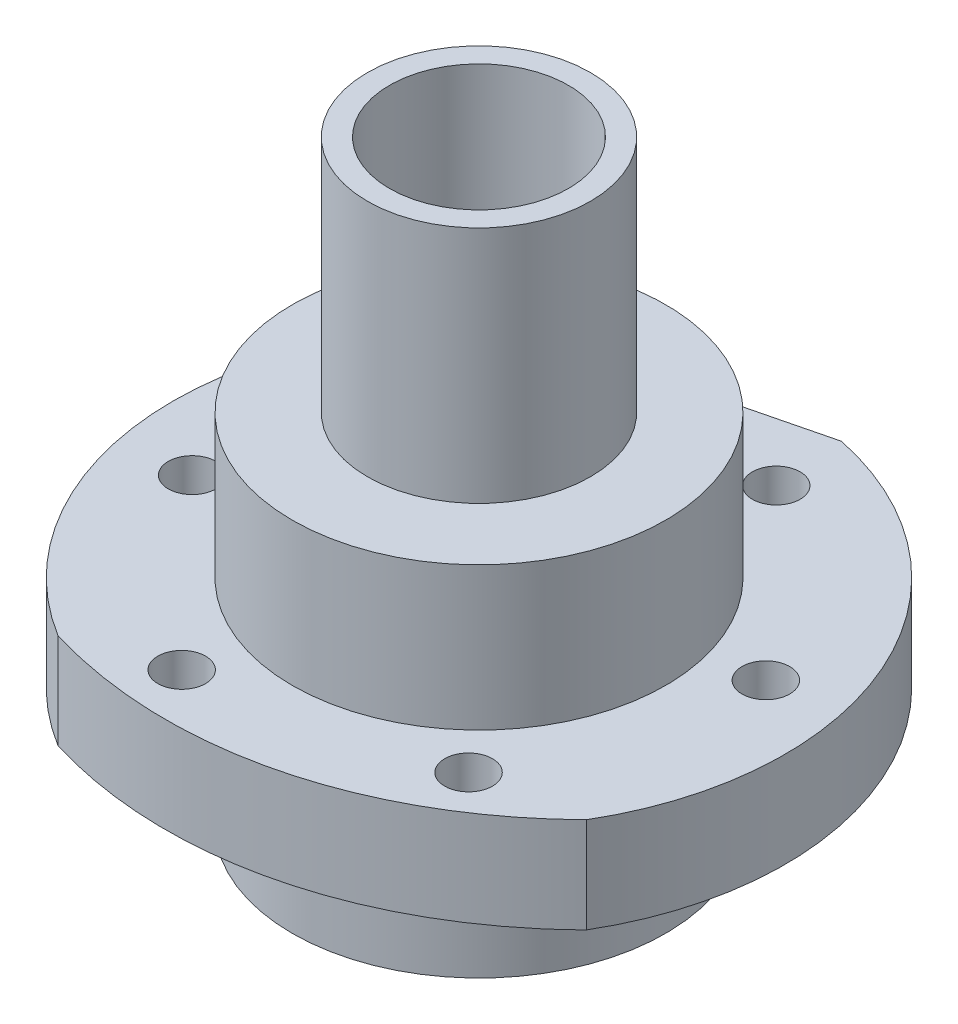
ISO-10303-21;
HEADER;
FILE_DESCRIPTION(('STEP AP214'),'2;1');
FILE_NAME('part.step','',(''),(''),'','','');
FILE_SCHEMA(('AUTOMOTIVE_DESIGN { 1 0 10303 214 1 1 1 1 }'));
ENDSEC;
DATA;
#1=APPLICATION_CONTEXT('core data for automotive mechanical design processes');
#2=APPLICATION_PROTOCOL_DEFINITION('international standard','automotive_design',2000,#1);
#3=PRODUCT_CONTEXT('',#1,'mechanical');
#4=PRODUCT('Part','Part','',(#3));
#5=PRODUCT_RELATED_PRODUCT_CATEGORY('part','',(#4));
#6=PRODUCT_DEFINITION_FORMATION('','',#4);
#7=PRODUCT_DEFINITION_CONTEXT('part definition',#1,'design');
#8=PRODUCT_DEFINITION('design','',#6,#7);
#9=PRODUCT_DEFINITION_SHAPE('','',#8);
#10=(LENGTH_UNIT() NAMED_UNIT(*) SI_UNIT(.MILLI.,.METRE.));
#11=(NAMED_UNIT(*) PLANE_ANGLE_UNIT() SI_UNIT($,.RADIAN.));
#12=(NAMED_UNIT(*) SI_UNIT($,.STERADIAN.) SOLID_ANGLE_UNIT());
#13=UNCERTAINTY_MEASURE_WITH_UNIT(LENGTH_MEASURE(1.E-05),#10,'distance_accuracy_value','');
#14=(GEOMETRIC_REPRESENTATION_CONTEXT(3) GLOBAL_UNCERTAINTY_ASSIGNED_CONTEXT((#13)) GLOBAL_UNIT_ASSIGNED_CONTEXT((#10,
#11,#12)) REPRESENTATION_CONTEXT('',''));
#15=CARTESIAN_POINT('',(0.,0.,0.));
#16=DIRECTION('',(0.,0.,1.));
#17=DIRECTION('',(1.,0.,0.));
#18=AXIS2_PLACEMENT_3D('',#15,#16,#17);
#19=CARTESIAN_POINT('',(0.,30.,0.));
#20=DIRECTION('',(0.,1.,0.));
#21=DIRECTION('',(0.,0.,1.));
#22=AXIS2_PLACEMENT_3D('',#19,#20,#21);
#23=CYLINDRICAL_SURFACE('',#22,25.65);
#24=CARTESIAN_POINT('',(0.,10.,0.));
#25=DIRECTION('',(0.,1.,0.));
#26=DIRECTION('',(0.,0.,1.));
#27=AXIS2_PLACEMENT_3D('',#24,#25,#26);
#28=CIRCLE('',#27,25.65);
#29=CARTESIAN_POINT('',(22.0758732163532,10.,13.060563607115));
#30=VERTEX_POINT('',#29);
#31=CARTESIAN_POINT('',(5.28634553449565,10.,-25.0993436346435));
#32=VERTEX_POINT('',#31);
#33=EDGE_CURVE('E123',#30,#32,#28,.T.);
#34=ORIENTED_EDGE('',*,*,#33,.T.);
#35=DIRECTION('',(0.,1.,0.));
#36=VECTOR('',#35,1.);
#37=CARTESIAN_POINT('',(5.28634553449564,10.,-25.0993436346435));
#38=LINE('',#37,#36);
#39=CARTESIAN_POINT('',(5.28634553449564,18.,-25.0993436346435));
#40=VERTEX_POINT('',#39);
#41=EDGE_CURVE('E83',#32,#40,#38,.T.);
#42=ORIENTED_EDGE('',*,*,#41,.T.);
#43=CARTESIAN_POINT('',(0.,18.,0.));
#44=DIRECTION('',(0.,1.,0.));
#45=DIRECTION('',(0.,0.,1.));
#46=AXIS2_PLACEMENT_3D('',#43,#44,#45);
#47=CIRCLE('',#46,25.65);
#48=CARTESIAN_POINT('',(22.0758732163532,18.,13.060563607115));
#49=VERTEX_POINT('',#48);
#50=EDGE_CURVE('E117',#49,#40,#47,.T.);
#51=ORIENTED_EDGE('',*,*,#50,.F.);
#52=DIRECTION('',(0.,1.,0.));
#53=VECTOR('',#52,1.);
#54=CARTESIAN_POINT('',(22.0758732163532,10.,13.060563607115));
#55=LINE('',#54,#53);
#56=EDGE_CURVE('E140',#30,#49,#55,.T.);
#57=ORIENTED_EDGE('',*,*,#56,.F.);
#58=EDGE_LOOP('',(#34,#42,#51,#57));
#59=FACE_BOUND('',#58,.T.);
#60=ADVANCED_FACE('F55',(#59),#23,.T.);
#61=CARTESIAN_POINT('',(0.,30.,0.));
#62=DIRECTION('',(0.,1.,0.));
#63=DIRECTION('',(0.,0.,1.));
#64=AXIS2_PLACEMENT_3D('',#61,#62,#63);
#65=CYLINDRICAL_SURFACE('',#64,15.65);
#66=CARTESIAN_POINT('',(0.,10.,0.));
#67=DIRECTION('',(0.,1.,0.));
#68=DIRECTION('',(0.,0.,1.));
#69=AXIS2_PLACEMENT_3D('',#66,#67,#68);
#70=CIRCLE('',#69,15.65);
#71=CARTESIAN_POINT('',(0.,10.,15.65));
#72=VERTEX_POINT('',#71);
#73=EDGE_CURVE('E143',#72,#72,#70,.T.);
#74=ORIENTED_EDGE('',*,*,#73,.F.);
#75=EDGE_LOOP('',(#74));
#76=FACE_BOUND('',#75,.T.);
#77=CARTESIAN_POINT('',(0.,0.,0.));
#78=DIRECTION('',(0.,1.,0.));
#79=DIRECTION('',(0.,0.,1.));
#80=AXIS2_PLACEMENT_3D('',#77,#78,#79);
#81=CIRCLE('',#80,15.65);
#82=CARTESIAN_POINT('',(0.,0.,15.65));
#83=VERTEX_POINT('',#82);
#84=EDGE_CURVE('E13',#83,#83,#81,.T.);
#85=ORIENTED_EDGE('',*,*,#84,.T.);
#86=EDGE_LOOP('',(#85));
#87=FACE_BOUND('',#86,.T.);
#88=ADVANCED_FACE('F57',(#76,#87),#65,.T.);
#89=CARTESIAN_POINT('',(0.,0.,-12.65));
#90=DIRECTION('',(0.,1.,0.));
#91=DIRECTION('',(0.,0.,1.));
#92=AXIS2_PLACEMENT_3D('',#89,#90,#91);
#93=PLANE('',#92);
#94=ORIENTED_EDGE('',*,*,#84,.F.);
#95=EDGE_LOOP('',(#94));
#96=FACE_BOUND('',#95,.T.);
#97=CARTESIAN_POINT('',(0.,0.,0.));
#98=DIRECTION('',(0.,1.,0.));
#99=DIRECTION('',(0.,0.,1.));
#100=AXIS2_PLACEMENT_3D('',#97,#98,#99);
#101=CIRCLE('',#100,12.65);
#102=CARTESIAN_POINT('',(0.,0.,12.65));
#103=VERTEX_POINT('',#102);
#104=EDGE_CURVE('E67',#103,#103,#101,.T.);
#105=ORIENTED_EDGE('',*,*,#104,.T.);
#106=EDGE_LOOP('',(#105));
#107=FACE_BOUND('',#106,.T.);
#108=ADVANCED_FACE('F362',(#96,#107),#93,.F.);
#109=CARTESIAN_POINT('',(0.,30.,0.));
#110=DIRECTION('',(0.,1.,0.));
#111=DIRECTION('',(0.,0.,1.));
#112=AXIS2_PLACEMENT_3D('',#109,#110,#111);
#113=CYLINDRICAL_SURFACE('',#112,12.65);
#114=ORIENTED_EDGE('',*,*,#104,.F.);
#115=EDGE_LOOP('',(#114));
#116=FACE_BOUND('',#115,.T.);
#117=CARTESIAN_POINT('',(0.,22.,0.));
#118=DIRECTION('',(0.,1.,0.));
#119=DIRECTION('',(0.,0.,1.));
#120=AXIS2_PLACEMENT_3D('',#117,#118,#119);
#121=CIRCLE('',#120,12.65);
#122=CARTESIAN_POINT('',(0.,22.,12.65));
#123=VERTEX_POINT('',#122);
#124=EDGE_CURVE('E227',#123,#123,#121,.T.);
#125=ORIENTED_EDGE('',*,*,#124,.T.);
#126=EDGE_LOOP('',(#125));
#127=FACE_BOUND('',#126,.T.);
#128=ADVANCED_FACE('F587',(#116,#127),#113,.F.);
#129=CARTESIAN_POINT('',(0.,22.,-12.95));
#130=DIRECTION('',(0.,-1.,0.));
#131=DIRECTION('',(0.,0.,-1.));
#132=AXIS2_PLACEMENT_3D('',#129,#130,#131);
#133=PLANE('',#132);
#134=ORIENTED_EDGE('',*,*,#124,.F.);
#135=EDGE_LOOP('',(#134));
#136=FACE_BOUND('',#135,.T.);
#137=CARTESIAN_POINT('',(0.,22.,0.));
#138=DIRECTION('',(0.,1.,0.));
#139=DIRECTION('',(0.,0.,1.));
#140=AXIS2_PLACEMENT_3D('',#137,#138,#139);
#141=CIRCLE('',#140,12.95);
#142=CARTESIAN_POINT('',(0.,22.,12.95));
#143=VERTEX_POINT('',#142);
#144=EDGE_CURVE('E223',#143,#143,#141,.T.);
#145=ORIENTED_EDGE('',*,*,#144,.T.);
#146=EDGE_LOOP('',(#145));
#147=FACE_BOUND('',#146,.T.);
#148=ADVANCED_FACE('F577',(#136,#147),#133,.F.);
#149=CARTESIAN_POINT('',(0.,22.7,0.));
#150=DIRECTION('',(0.,1.,0.));
#151=DIRECTION('',(0.,0.,1.));
#152=AXIS2_PLACEMENT_3D('',#149,#150,#151);
#153=TOROIDAL_SURFACE('',#152,12.95,0.699999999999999);
#154=ORIENTED_EDGE('',*,*,#144,.F.);
#155=EDGE_LOOP('',(#154));
#156=FACE_BOUND('',#155,.T.);
#157=CARTESIAN_POINT('',(0.,22.7,0.));
#158=DIRECTION('',(0.,1.,0.));
#159=DIRECTION('',(0.,0.,1.));
#160=AXIS2_PLACEMENT_3D('',#157,#158,#159);
#161=CIRCLE('',#160,13.65);
#162=CARTESIAN_POINT('',(0.,22.7,13.65));
#163=VERTEX_POINT('',#162);
#164=EDGE_CURVE('E219',#163,#163,#161,.T.);
#165=ORIENTED_EDGE('',*,*,#164,.T.);
#166=EDGE_LOOP('',(#165));
#167=FACE_BOUND('',#166,.T.);
#168=ADVANCED_FACE('F567',(#156,#167),#153,.F.);
#169=CARTESIAN_POINT('',(0.,30.,0.));
#170=DIRECTION('',(0.,1.,0.));
#171=DIRECTION('',(0.,0.,1.));
#172=AXIS2_PLACEMENT_3D('',#169,#170,#171);
#173=CYLINDRICAL_SURFACE('',#172,13.65);
#174=ORIENTED_EDGE('',*,*,#164,.F.);
#175=EDGE_LOOP('',(#174));
#176=FACE_BOUND('',#175,.T.);
#177=CARTESIAN_POINT('',(0.,24.3,0.));
#178=DIRECTION('',(0.,1.,0.));
#179=DIRECTION('',(0.,0.,1.));
#180=AXIS2_PLACEMENT_3D('',#177,#178,#179);
#181=CIRCLE('',#180,13.65);
#182=CARTESIAN_POINT('',(0.,24.3,13.65));
#183=VERTEX_POINT('',#182);
#184=EDGE_CURVE('E215',#183,#183,#181,.T.);
#185=ORIENTED_EDGE('',*,*,#184,.T.);
#186=EDGE_LOOP('',(#185));
#187=FACE_BOUND('',#186,.T.);
#188=ADVANCED_FACE('F557',(#176,#187),#173,.F.);
#189=CARTESIAN_POINT('',(0.,24.3,0.));
#190=DIRECTION('',(0.,1.,0.));
#191=DIRECTION('',(0.,0.,1.));
#192=AXIS2_PLACEMENT_3D('',#189,#190,#191);
#193=TOROIDAL_SURFACE('',#192,12.95,0.699999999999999);
#194=ORIENTED_EDGE('',*,*,#184,.F.);
#195=EDGE_LOOP('',(#194));
#196=FACE_BOUND('',#195,.T.);
#197=CARTESIAN_POINT('',(0.,25.,0.));
#198=DIRECTION('',(0.,1.,0.));
#199=DIRECTION('',(0.,0.,1.));
#200=AXIS2_PLACEMENT_3D('',#197,#198,#199);
#201=CIRCLE('',#200,12.95);
#202=CARTESIAN_POINT('',(0.,25.,12.95));
#203=VERTEX_POINT('',#202);
#204=EDGE_CURVE('E211',#203,#203,#201,.T.);
#205=ORIENTED_EDGE('',*,*,#204,.T.);
#206=EDGE_LOOP('',(#205));
#207=FACE_BOUND('',#206,.T.);
#208=ADVANCED_FACE('F547',(#196,#207),#193,.F.);
#209=CARTESIAN_POINT('',(0.,25.,-12.65));
#210=DIRECTION('',(0.,1.,0.));
#211=DIRECTION('',(0.,0.,1.));
#212=AXIS2_PLACEMENT_3D('',#209,#210,#211);
#213=PLANE('',#212);
#214=ORIENTED_EDGE('',*,*,#204,.F.);
#215=EDGE_LOOP('',(#214));
#216=FACE_BOUND('',#215,.T.);
#217=CARTESIAN_POINT('',(0.,25.,0.));
#218=DIRECTION('',(0.,1.,0.));
#219=DIRECTION('',(0.,0.,1.));
#220=AXIS2_PLACEMENT_3D('',#217,#218,#219);
#221=CIRCLE('',#220,12.65);
#222=CARTESIAN_POINT('',(0.,25.,12.65));
#223=VERTEX_POINT('',#222);
#224=EDGE_CURVE('E207',#223,#223,#221,.T.);
#225=ORIENTED_EDGE('',*,*,#224,.T.);
#226=EDGE_LOOP('',(#225));
#227=FACE_BOUND('',#226,.T.);
#228=ADVANCED_FACE('F537',(#216,#227),#213,.F.);
#229=CARTESIAN_POINT('',(0.,30.,0.));
#230=DIRECTION('',(0.,1.,0.));
#231=DIRECTION('',(0.,0.,1.));
#232=AXIS2_PLACEMENT_3D('',#229,#230,#231);
#233=CYLINDRICAL_SURFACE('',#232,12.65);
#234=ORIENTED_EDGE('',*,*,#224,.F.);
#235=EDGE_LOOP('',(#234));
#236=FACE_BOUND('',#235,.T.);
#237=CARTESIAN_POINT('',(0.,27.,0.));
#238=DIRECTION('',(0.,1.,0.));
#239=DIRECTION('',(0.,0.,1.));
#240=AXIS2_PLACEMENT_3D('',#237,#238,#239);
#241=CIRCLE('',#240,12.65);
#242=CARTESIAN_POINT('',(0.,27.,12.65));
#243=VERTEX_POINT('',#242);
#244=EDGE_CURVE('E203',#243,#243,#241,.T.);
#245=ORIENTED_EDGE('',*,*,#244,.T.);
#246=EDGE_LOOP('',(#245));
#247=FACE_BOUND('',#246,.T.);
#248=ADVANCED_FACE('F527',(#236,#247),#233,.F.);
#249=CARTESIAN_POINT('',(0.,27.,-7.5));
#250=DIRECTION('',(0.,1.,0.));
#251=DIRECTION('',(0.,0.,1.));
#252=AXIS2_PLACEMENT_3D('',#249,#250,#251);
#253=PLANE('',#252);
#254=ORIENTED_EDGE('',*,*,#244,.F.);
#255=EDGE_LOOP('',(#254));
#256=FACE_BOUND('',#255,.T.);
#257=CARTESIAN_POINT('',(0.,27.,0.));
#258=DIRECTION('',(0.,1.,0.));
#259=DIRECTION('',(0.,0.,1.));
#260=AXIS2_PLACEMENT_3D('',#257,#258,#259);
#261=CIRCLE('',#260,7.5);
#262=CARTESIAN_POINT('',(0.,27.,7.5));
#263=VERTEX_POINT('',#262);
#264=EDGE_CURVE('E199',#263,#263,#261,.T.);
#265=ORIENTED_EDGE('',*,*,#264,.T.);
#266=EDGE_LOOP('',(#265));
#267=FACE_BOUND('',#266,.T.);
#268=ADVANCED_FACE('F518',(#256,#267),#253,.F.);
#269=CARTESIAN_POINT('',(0.,30.,0.));
#270=DIRECTION('',(0.,1.,0.));
#271=DIRECTION('',(0.,0.,1.));
#272=AXIS2_PLACEMENT_3D('',#269,#270,#271);
#273=CYLINDRICAL_SURFACE('',#272,7.5);
#274=ORIENTED_EDGE('',*,*,#264,.F.);
#275=EDGE_LOOP('',(#274));
#276=FACE_BOUND('',#275,.T.);
#277=CARTESIAN_POINT('',(0.,50.,0.));
#278=DIRECTION('',(0.,1.,0.));
#279=DIRECTION('',(0.,0.,1.));
#280=AXIS2_PLACEMENT_3D('',#277,#278,#279);
#281=CIRCLE('',#280,7.5);
#282=CARTESIAN_POINT('',(0.,50.,7.5));
#283=VERTEX_POINT('',#282);
#284=EDGE_CURVE('E195',#283,#283,#281,.T.);
#285=ORIENTED_EDGE('',*,*,#284,.T.);
#286=EDGE_LOOP('',(#285));
#287=FACE_BOUND('',#286,.T.);
#288=ADVANCED_FACE('F507',(#276,#287),#273,.F.);
#289=CARTESIAN_POINT('',(0.,50.,-7.5));
#290=DIRECTION('',(0.,-1.,0.));
#291=DIRECTION('',(0.,0.,-1.));
#292=AXIS2_PLACEMENT_3D('',#289,#290,#291);
#293=PLANE('',#292);
#294=ORIENTED_EDGE('',*,*,#284,.F.);
#295=EDGE_LOOP('',(#294));
#296=FACE_BOUND('',#295,.T.);
#297=CARTESIAN_POINT('',(0.,50.,0.));
#298=DIRECTION('',(0.,1.,0.));
#299=DIRECTION('',(0.,0.,1.));
#300=AXIS2_PLACEMENT_3D('',#297,#298,#299);
#301=CIRCLE('',#300,9.35);
#302=CARTESIAN_POINT('',(0.,50.,9.35));
#303=VERTEX_POINT('',#302);
#304=EDGE_CURVE('E191',#303,#303,#301,.T.);
#305=ORIENTED_EDGE('',*,*,#304,.T.);
#306=EDGE_LOOP('',(#305));
#307=FACE_BOUND('',#306,.T.);
#308=ADVANCED_FACE('F497',(#296,#307),#293,.F.);
#309=CARTESIAN_POINT('',(0.,30.,0.));
#310=DIRECTION('',(0.,1.,0.));
#311=DIRECTION('',(0.,0.,1.));
#312=AXIS2_PLACEMENT_3D('',#309,#310,#311);
#313=CYLINDRICAL_SURFACE('',#312,9.35);
#314=ORIENTED_EDGE('',*,*,#304,.F.);
#315=EDGE_LOOP('',(#314));
#316=FACE_BOUND('',#315,.T.);
#317=CARTESIAN_POINT('',(0.,30.,0.));
#318=DIRECTION('',(0.,1.,0.));
#319=DIRECTION('',(0.,0.,1.));
#320=AXIS2_PLACEMENT_3D('',#317,#318,#319);
#321=CIRCLE('',#320,9.35);
#322=CARTESIAN_POINT('',(0.,30.,9.35));
#323=VERTEX_POINT('',#322);
#324=EDGE_CURVE('E187',#323,#323,#321,.T.);
#325=ORIENTED_EDGE('',*,*,#324,.T.);
#326=EDGE_LOOP('',(#325));
#327=FACE_BOUND('',#326,.T.);
#328=ADVANCED_FACE('F354',(#316,#327),#313,.T.);
#329=CARTESIAN_POINT('',(0.,30.,-15.65));
#330=DIRECTION('',(0.,-1.,0.));
#331=DIRECTION('',(0.,0.,-1.));
#332=AXIS2_PLACEMENT_3D('',#329,#330,#331);
#333=PLANE('',#332);
#334=ORIENTED_EDGE('',*,*,#324,.F.);
#335=EDGE_LOOP('',(#334));
#336=FACE_BOUND('',#335,.T.);
#337=CARTESIAN_POINT('',(0.,30.,0.));
#338=DIRECTION('',(0.,1.,0.));
#339=DIRECTION('',(0.,0.,1.));
#340=AXIS2_PLACEMENT_3D('',#337,#338,#339);
#341=CIRCLE('',#340,15.65);
#342=CARTESIAN_POINT('',(0.,30.,15.65));
#343=VERTEX_POINT('',#342);
#344=EDGE_CURVE('E183',#343,#343,#341,.T.);
#345=ORIENTED_EDGE('',*,*,#344,.T.);
#346=EDGE_LOOP('',(#345));
#347=FACE_BOUND('',#346,.T.);
#348=ADVANCED_FACE('F348',(#336,#347),#333,.F.);
#349=CARTESIAN_POINT('',(0.,30.,0.));
#350=DIRECTION('',(0.,1.,0.));
#351=DIRECTION('',(0.,0.,1.));
#352=AXIS2_PLACEMENT_3D('',#349,#350,#351);
#353=CYLINDRICAL_SURFACE('',#352,15.65);
#354=ORIENTED_EDGE('',*,*,#344,.F.);
#355=EDGE_LOOP('',(#354));
#356=FACE_BOUND('',#355,.T.);
#357=CARTESIAN_POINT('',(0.,18.,0.));
#358=DIRECTION('',(0.,1.,0.));
#359=DIRECTION('',(0.,0.,1.));
#360=AXIS2_PLACEMENT_3D('',#357,#358,#359);
#361=CIRCLE('',#360,15.65);
#362=CARTESIAN_POINT('',(0.,18.,15.65));
#363=VERTEX_POINT('',#362);
#364=EDGE_CURVE('E128',#363,#363,#361,.T.);
#365=ORIENTED_EDGE('',*,*,#364,.T.);
#366=EDGE_LOOP('',(#365));
#367=FACE_BOUND('',#366,.T.);
#368=ADVANCED_FACE('F337',(#356,#367),#353,.T.);
#369=CARTESIAN_POINT('',(0.,18.,-25.65));
#370=DIRECTION('',(0.,-1.,0.));
#371=DIRECTION('',(0.,0.,-1.));
#372=AXIS2_PLACEMENT_3D('',#369,#370,#371);
#373=PLANE('',#372);
#374=CARTESIAN_POINT('',(-5.77047814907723,18.,19.1494538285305));
#375=DIRECTION('',(0.,1.,0.));
#376=DIRECTION('',(0.,0.,1.));
#377=AXIS2_PLACEMENT_3D('',#374,#375,#376);
#378=CIRCLE('',#377,2.);
#379=CARTESIAN_POINT('',(-5.77047814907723,18.,21.1494538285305));
#380=VERTEX_POINT('',#379);
#381=EDGE_CURVE('E270',#380,#380,#378,.T.);
#382=ORIENTED_EDGE('',*,*,#381,.F.);
#383=EDGE_LOOP('',(#382));
#384=FACE_BOUND('',#383,.T.);
#385=CARTESIAN_POINT('',(-13.698674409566,18.,-14.5721075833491));
#386=DIRECTION('',(0.,1.,0.));
#387=DIRECTION('',(0.,0.,1.));
#388=AXIS2_PLACEMENT_3D('',#385,#386,#387);
#389=CIRCLE('',#388,2.);
#390=CARTESIAN_POINT('',(-13.698674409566,18.,-12.5721075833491));
#391=VERTEX_POINT('',#390);
#392=EDGE_CURVE('E280',#391,#391,#389,.T.);
#393=ORIENTED_EDGE('',*,*,#392,.F.);
#394=EDGE_LOOP('',(#393));
#395=FACE_BOUND('',#394,.T.);
#396=CARTESIAN_POINT('',(-19.4691525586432,18.,4.57734624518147));
#397=DIRECTION('',(0.,1.,0.));
#398=DIRECTION('',(0.,0.,1.));
#399=AXIS2_PLACEMENT_3D('',#396,#397,#398);
#400=CIRCLE('',#399,2.);
#401=CARTESIAN_POINT('',(-19.4691525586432,18.,6.57734624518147));
#402=VERTEX_POINT('',#401);
#403=EDGE_CURVE('E312',#402,#402,#400,.T.);
#404=ORIENTED_EDGE('',*,*,#403,.F.);
#405=EDGE_LOOP('',(#404));
#406=FACE_BOUND('',#405,.T.);
#407=CARTESIAN_POINT('',(5.77047814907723,18.,-19.1494538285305));
#408=DIRECTION('',(0.,1.,0.));
#409=DIRECTION('',(0.,0.,1.));
#410=AXIS2_PLACEMENT_3D('',#407,#408,#409);
#411=CIRCLE('',#410,2.);
#412=CARTESIAN_POINT('',(5.77047814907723,18.,-17.1494538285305));
#413=VERTEX_POINT('',#412);
#414=EDGE_CURVE('E304',#413,#413,#411,.T.);
#415=ORIENTED_EDGE('',*,*,#414,.F.);
#416=EDGE_LOOP('',(#415));
#417=FACE_BOUND('',#416,.T.);
#418=CARTESIAN_POINT('',(19.4691525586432,18.,-4.57734624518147));
#419=DIRECTION('',(0.,1.,0.));
#420=DIRECTION('',(0.,0.,1.));
#421=AXIS2_PLACEMENT_3D('',#418,#419,#420);
#422=CIRCLE('',#421,2.);
#423=CARTESIAN_POINT('',(19.4691525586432,18.,-2.57734624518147));
#424=VERTEX_POINT('',#423);
#425=EDGE_CURVE('E296',#424,#424,#422,.T.);
#426=ORIENTED_EDGE('',*,*,#425,.F.);
#427=EDGE_LOOP('',(#426));
#428=FACE_BOUND('',#427,.T.);
#429=CARTESIAN_POINT('',(13.698674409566,18.,14.5721075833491));
#430=DIRECTION('',(0.,1.,0.));
#431=DIRECTION('',(0.,0.,1.));
#432=AXIS2_PLACEMENT_3D('',#429,#430,#431);
#433=CIRCLE('',#432,2.);
#434=CARTESIAN_POINT('',(13.698674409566,18.,16.5721075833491));
#435=VERTEX_POINT('',#434);
#436=EDGE_CURVE('E277',#435,#435,#433,.T.);
#437=ORIENTED_EDGE('',*,*,#436,.F.);
#438=EDGE_LOOP('',(#437));
#439=FACE_BOUND('',#438,.T.);
#440=ORIENTED_EDGE('',*,*,#364,.F.);
#441=EDGE_LOOP('',(#440));
#442=FACE_BOUND('',#441,.T.);
#443=ORIENTED_EDGE('',*,*,#50,.T.);
#444=DIRECTION('',(0.970707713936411,0.,-0.240263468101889));
#445=VECTOR('',#444,1.);
#446=CARTESIAN_POINT('',(-16.3836397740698,18.,-19.7357251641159));
#447=LINE('',#446,#445);
#448=CARTESIAN_POINT('',(-16.3836397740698,18.,-19.7357251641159));
#449=VERTEX_POINT('',#448);
#450=EDGE_CURVE('E102',#449,#40,#447,.T.);
#451=ORIENTED_EDGE('',*,*,#450,.F.);
#452=CARTESIAN_POINT('',(-13.4350303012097,18.,21.8499991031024));
#453=VERTEX_POINT('',#452);
#454=EDGE_CURVE('E115',#449,#453,#47,.T.);
#455=ORIENTED_EDGE('',*,*,#454,.T.);
#456=CARTESIAN_POINT('',(22.0758732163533,18.,13.0605636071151));
#457=CARTESIAN_POINT('',(21.2724483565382,18.,13.8528622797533));
#458=CARTESIAN_POINT('',(19.4430643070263,18.,15.5041878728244));
#459=CARTESIAN_POINT('',(16.3920906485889,18.,17.7520788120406));
#460=CARTESIAN_POINT('',(12.9511147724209,18.,19.7433907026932));
#461=CARTESIAN_POINT('',(9.33086060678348,18.,21.3278201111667));
#462=CARTESIAN_POINT('',(5.56652629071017,18.,22.4897694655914));
#463=CARTESIAN_POINT('',(1.69480324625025,18.,23.2178490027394));
#464=CARTESIAN_POINT('',(-2.24654047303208,18.,23.5050187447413));
#465=CARTESIAN_POINT('',(-6.21909495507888,18.,23.348657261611));
#466=CARTESIAN_POINT('',(-9.96635577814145,18.,22.7834225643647));
#467=CARTESIAN_POINT('',(-12.3547946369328,18.,22.1760659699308));
#468=CARTESIAN_POINT('',(-13.4350303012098,18.,21.8499991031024));
#469=B_SPLINE_CURVE_WITH_KNOTS('',3,(#456,#457,#458,#459,#460,#461,#462,#463,#464,#465,#466,
#467,#468),.UNSPECIFIED.,.F.,.F.,(4,1,1,1,1,1,1,1,1,1,4),(0.358219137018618,0.383187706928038,
0.412698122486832,0.441949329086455,0.47102064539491,0.499999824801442,0.528979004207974,
0.558050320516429,0.587301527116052,0.616811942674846,0.641780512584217),.UNSPECIFIED.);
#470=EDGE_CURVE('E119',#49,#453,#469,.T.);
#471=ORIENTED_EDGE('',*,*,#470,.F.);
#472=EDGE_LOOP('',(#443,#451,#455,#471));
#473=FACE_BOUND('',#472,.T.);
#474=ADVANCED_FACE('F113',(#384,#395,#406,#417,#428,#439,#442,#473),#373,.F.);
#475=ORIENTED_EDGE('',*,*,#454,.F.);
#476=DIRECTION('',(0.,1.,0.));
#477=VECTOR('',#476,1.);
#478=CARTESIAN_POINT('',(-16.3836397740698,10.,-19.7357251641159));
#479=LINE('',#478,#477);
#480=CARTESIAN_POINT('',(-16.3836397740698,10.,-19.7357251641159));
#481=VERTEX_POINT('',#480);
#482=EDGE_CURVE('E99',#481,#449,#479,.T.);
#483=ORIENTED_EDGE('',*,*,#482,.F.);
#484=CARTESIAN_POINT('',(-13.4350303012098,10.,21.8499991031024));
#485=VERTEX_POINT('',#484);
#486=EDGE_CURVE('E131',#481,#485,#28,.T.);
#487=ORIENTED_EDGE('',*,*,#486,.T.);
#488=DIRECTION('',(0.,1.,0.));
#489=VECTOR('',#488,1.);
#490=CARTESIAN_POINT('',(-13.4350303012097,10.,21.8499991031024));
#491=LINE('',#490,#489);
#492=EDGE_CURVE('E75',#485,#453,#491,.T.);
#493=ORIENTED_EDGE('',*,*,#492,.T.);
#494=EDGE_LOOP('',(#475,#483,#487,#493));
#495=FACE_BOUND('',#494,.T.);
#496=ADVANCED_FACE('F121',(#495),#23,.T.);
#497=CARTESIAN_POINT('',(0.,10.,-15.65));
#498=DIRECTION('',(0.,1.,0.));
#499=DIRECTION('',(0.,0.,1.));
#500=AXIS2_PLACEMENT_3D('',#497,#498,#499);
#501=PLANE('',#500);
#502=CARTESIAN_POINT('',(-5.77047814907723,10.,19.1494538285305));
#503=DIRECTION('',(0.,1.,0.));
#504=DIRECTION('',(0.,0.,1.));
#505=AXIS2_PLACEMENT_3D('',#502,#503,#504);
#506=CIRCLE('',#505,2.);
#507=CARTESIAN_POINT('',(-5.77047814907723,10.,21.1494538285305));
#508=VERTEX_POINT('',#507);
#509=EDGE_CURVE('E255',#508,#508,#506,.T.);
#510=ORIENTED_EDGE('',*,*,#509,.T.);
#511=EDGE_LOOP('',(#510));
#512=FACE_BOUND('',#511,.T.);
#513=CARTESIAN_POINT('',(-13.698674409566,10.,-14.5721075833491));
#514=DIRECTION('',(0.,1.,0.));
#515=DIRECTION('',(0.,0.,1.));
#516=AXIS2_PLACEMENT_3D('',#513,#514,#515);
#517=CIRCLE('',#516,2.);
#518=CARTESIAN_POINT('',(-13.698674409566,10.,-12.5721075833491));
#519=VERTEX_POINT('',#518);
#520=EDGE_CURVE('E285',#519,#519,#517,.T.);
#521=ORIENTED_EDGE('',*,*,#520,.T.);
#522=EDGE_LOOP('',(#521));
#523=FACE_BOUND('',#522,.T.);
#524=CARTESIAN_POINT('',(-19.4691525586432,10.,4.57734624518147));
#525=DIRECTION('',(0.,1.,0.));
#526=DIRECTION('',(0.,0.,1.));
#527=AXIS2_PLACEMENT_3D('',#524,#525,#526);
#528=CIRCLE('',#527,2.);
#529=CARTESIAN_POINT('',(-19.4691525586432,10.,6.57734624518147));
#530=VERTEX_POINT('',#529);
#531=EDGE_CURVE('E284',#530,#530,#528,.T.);
#532=ORIENTED_EDGE('',*,*,#531,.T.);
#533=EDGE_LOOP('',(#532));
#534=FACE_BOUND('',#533,.T.);
#535=CARTESIAN_POINT('',(5.77047814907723,10.,-19.1494538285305));
#536=DIRECTION('',(0.,1.,0.));
#537=DIRECTION('',(0.,0.,1.));
#538=AXIS2_PLACEMENT_3D('',#535,#536,#537);
#539=CIRCLE('',#538,2.);
#540=CARTESIAN_POINT('',(5.77047814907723,10.,-17.1494538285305));
#541=VERTEX_POINT('',#540);
#542=EDGE_CURVE('E308',#541,#541,#539,.T.);
#543=ORIENTED_EDGE('',*,*,#542,.T.);
#544=EDGE_LOOP('',(#543));
#545=FACE_BOUND('',#544,.T.);
#546=CARTESIAN_POINT('',(19.4691525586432,10.,-4.57734624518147));
#547=DIRECTION('',(0.,1.,0.));
#548=DIRECTION('',(0.,0.,1.));
#549=AXIS2_PLACEMENT_3D('',#546,#547,#548);
#550=CIRCLE('',#549,2.);
#551=CARTESIAN_POINT('',(19.4691525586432,10.,-2.57734624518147));
#552=VERTEX_POINT('',#551);
#553=EDGE_CURVE('E300',#552,#552,#550,.T.);
#554=ORIENTED_EDGE('',*,*,#553,.T.);
#555=EDGE_LOOP('',(#554));
#556=FACE_BOUND('',#555,.T.);
#557=CARTESIAN_POINT('',(13.698674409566,10.,14.5721075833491));
#558=DIRECTION('',(0.,1.,0.));
#559=DIRECTION('',(0.,0.,1.));
#560=AXIS2_PLACEMENT_3D('',#557,#558,#559);
#561=CIRCLE('',#560,2.);
#562=CARTESIAN_POINT('',(13.698674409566,10.,16.5721075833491));
#563=VERTEX_POINT('',#562);
#564=EDGE_CURVE('E292',#563,#563,#561,.T.);
#565=ORIENTED_EDGE('',*,*,#564,.T.);
#566=EDGE_LOOP('',(#565));
#567=FACE_BOUND('',#566,.T.);
#568=ORIENTED_EDGE('',*,*,#486,.F.);
#569=DIRECTION('',(0.970707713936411,0.,-0.240263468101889));
#570=VECTOR('',#569,1.);
#571=CARTESIAN_POINT('',(-16.3836397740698,10.,-19.7357251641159));
#572=LINE('',#571,#570);
#573=EDGE_CURVE('E103',#481,#32,#572,.T.);
#574=ORIENTED_EDGE('',*,*,#573,.T.);
#575=ORIENTED_EDGE('',*,*,#33,.F.);
#576=CARTESIAN_POINT('',(-13.4350303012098,10.,21.8499991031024));
#577=CARTESIAN_POINT('',(-12.3547946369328,10.,22.1760659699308));
#578=CARTESIAN_POINT('',(-9.96635577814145,10.,22.7834225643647));
#579=CARTESIAN_POINT('',(-6.21909495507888,10.,23.348657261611));
#580=CARTESIAN_POINT('',(-2.24654047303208,10.,23.5050187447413));
#581=CARTESIAN_POINT('',(1.69480324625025,10.,23.2178490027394));
#582=CARTESIAN_POINT('',(5.56652629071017,10.,22.4897694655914));
#583=CARTESIAN_POINT('',(9.33086060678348,10.,21.3278201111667));
#584=CARTESIAN_POINT('',(12.9511147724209,10.,19.7433907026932));
#585=CARTESIAN_POINT('',(16.3920906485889,10.,17.7520788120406));
#586=CARTESIAN_POINT('',(19.4430643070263,10.,15.5041878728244));
#587=CARTESIAN_POINT('',(21.2724483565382,10.,13.8528622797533));
#588=CARTESIAN_POINT('',(22.0758732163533,10.,13.0605636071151));
#589=B_SPLINE_CURVE_WITH_KNOTS('',3,(#576,#577,#578,#579,#580,#581,#582,#583,#584,#585,#586,
#587,#588),.UNSPECIFIED.,.F.,.F.,(4,1,1,1,1,1,1,1,1,1,4),(0.358219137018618,0.383187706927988,
0.412698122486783,0.441949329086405,0.47102064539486,0.499999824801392,0.528979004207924,
0.55805032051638,0.587301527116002,0.616811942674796,0.641780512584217),.UNSPECIFIED.);
#590=EDGE_CURVE('E137',#30,#485,#589,.F.);
#591=ORIENTED_EDGE('',*,*,#590,.T.);
#592=EDGE_LOOP('',(#568,#574,#575,#591));
#593=FACE_BOUND('',#592,.T.);
#594=ORIENTED_EDGE('',*,*,#73,.T.);
#595=EDGE_LOOP('',(#594));
#596=FACE_BOUND('',#595,.T.);
#597=ADVANCED_FACE('F166',(#512,#523,#534,#545,#556,#567,#593,#596),#501,.F.);
#598=CARTESIAN_POINT('',(33.2796614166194,10.,-32.028073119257));
#599=CARTESIAN_POINT('',(33.3682293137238,10.,-31.6606093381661));
#600=CARTESIAN_POINT('',(33.5452984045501,10.,-30.925958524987));
#601=CARTESIAN_POINT('',(33.7810766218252,10.,-29.8173921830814));
#602=CARTESIAN_POINT('',(33.9948169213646,10.,-28.7047727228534));
#603=CARTESIAN_POINT('',(34.2473898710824,10.,-27.2164882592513));
#604=CARTESIAN_POINT('',(34.5036326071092,10.,-25.3485646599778));
#605=CARTESIAN_POINT('',(34.7144969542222,10.,-23.0994694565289));
#606=CARTESIAN_POINT('',(34.8286107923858,10.,-20.8486679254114));
#607=CARTESIAN_POINT('',(34.85091008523,10.,-17.8586445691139));
#608=CARTESIAN_POINT('',(34.6372453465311,10.,-14.1454449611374));
#609=CARTESIAN_POINT('',(33.9939981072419,10.,-9.76127218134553));
#610=CARTESIAN_POINT('',(32.9704480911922,10.,-5.49793789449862));
#611=CARTESIAN_POINT('',(31.5761821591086,10.,-1.39657659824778));
#612=CARTESIAN_POINT('',(29.8243422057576,10.,2.50343966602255));
#613=CARTESIAN_POINT('',(27.7314769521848,10.,6.16452353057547));
#614=CARTESIAN_POINT('',(25.3174170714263,10.,9.55130801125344));
#615=CARTESIAN_POINT('',(22.6051146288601,10.,12.6309552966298));
#616=CARTESIAN_POINT('',(19.6204634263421,10.,15.3734840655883));
#617=CARTESIAN_POINT('',(16.3920906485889,10.,17.7520788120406));
#618=CARTESIAN_POINT('',(12.9511147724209,10.,19.7433907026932));
#619=CARTESIAN_POINT('',(9.33086060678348,10.,21.3278201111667));
#620=CARTESIAN_POINT('',(5.56652629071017,10.,22.4897694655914));
#621=CARTESIAN_POINT('',(1.69480324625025,10.,23.2178490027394));
#622=CARTESIAN_POINT('',(-2.24654047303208,10.,23.5050187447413));
#623=CARTESIAN_POINT('',(-6.21909495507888,10.,23.348657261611));
#624=CARTESIAN_POINT('',(-10.1842405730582,10.,22.7505569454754));
#625=CARTESIAN_POINT('',(-14.1035604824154,10.,21.7168556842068));
#626=CARTESIAN_POINT('',(-17.9392244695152,10.,20.257919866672));
#627=CARTESIAN_POINT('',(-21.6543434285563,10.,18.3881911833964));
#628=CARTESIAN_POINT('',(-25.2132979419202,10.,16.1260102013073));
#629=CARTESIAN_POINT('',(-28.5820498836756,10.,13.4934106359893));
#630=CARTESIAN_POINT('',(-31.7284284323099,10.,10.5159211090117));
#631=CARTESIAN_POINT('',(-34.622443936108,10.,7.22223797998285));
#632=CARTESIAN_POINT('',(-37.2364287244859,10.,3.64427486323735));
#633=CARTESIAN_POINT('',(-39.1574524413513,10.,0.459439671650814));
#634=CARTESIAN_POINT('',(-40.5324260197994,10.,-2.19577775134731));
#635=CARTESIAN_POINT('',(-41.4813811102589,10.,-4.23994616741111));
#636=CARTESIAN_POINT('',(-42.3439358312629,10.,-6.32773326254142));
#637=CARTESIAN_POINT('',(-42.945581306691,10.,-7.98121373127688));
#638=CARTESIAN_POINT('',(-43.3419990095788,10.,-9.1748868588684));
#639=CARTESIAN_POINT('',(-43.5698233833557,10.,-9.89494533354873));
#640=CARTESIAN_POINT('',(-43.7874562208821,10.,-10.6181484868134));
#641=CARTESIAN_POINT('',(-43.9946466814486,10.,-11.3445625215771));
#642=CARTESIAN_POINT('',(-44.1923381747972,10.,-12.0739527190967));
#643=CARTESIAN_POINT('',(-44.3154041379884,10.,-12.5625989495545));
#644=CARTESIAN_POINT('',(-44.3769556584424,10.,-12.8069956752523));
#645=B_SPLINE_CURVE_WITH_KNOTS('',3,(#598,#599,#600,#601,#602,#603,#604,#605,#606,#607,#608,
#609,#610,#611,#612,#613,#614,#615,#616,#617,#618,#619,#620,#621,#622,#623,#624,#625,#626,#627,
#628,#629,#630,#631,#632,#633,#634,#635,#636,#637,#638,#639,#640,#641,#642,#643,#644),
.UNSPECIFIED.,.F.,.F.,(4,1,1,1,1,1,1,1,1,1,1,1,1,1,1,1,1,1,1,1,1,1,1,1,1,1,1,1,1,1,1,1,1,1,1,1,
1,1,1,1,1,1,1,1,4),(0.,0.0083677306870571,0.0167291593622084,0.0250880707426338,
0.0334482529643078,0.0501463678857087,0.0668145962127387,0.0834433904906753,0.10002342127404,
0.132994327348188,0.165669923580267,0.197994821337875,0.229925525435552,0.261432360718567,
0.292501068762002,0.323133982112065,0.353350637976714,0.383187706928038,0.412698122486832,
0.441949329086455,0.47102064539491,0.499999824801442,0.528979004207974,0.558050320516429,
0.587301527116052,0.616811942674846,0.64664901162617,0.676865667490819,0.707498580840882,
0.738567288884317,0.770074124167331,0.802004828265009,0.834329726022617,0.867005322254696,
0.899976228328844,0.916556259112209,0.933185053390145,0.949853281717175,0.966551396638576,
0.972125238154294,0.977697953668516,0.983270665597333,0.988844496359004,0.994420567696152,1.),.UNSPECIFIED.);
#646=DIRECTION('',(0.,1.,0.));
#647=VECTOR('',#646,1.);
#648=SURFACE_OF_LINEAR_EXTRUSION('',#645,#647);
#649=ORIENTED_EDGE('',*,*,#470,.T.);
#650=ORIENTED_EDGE('',*,*,#492,.F.);
#651=ORIENTED_EDGE('',*,*,#590,.F.);
#652=ORIENTED_EDGE('',*,*,#56,.T.);
#653=EDGE_LOOP('',(#649,#650,#651,#652));
#654=FACE_BOUND('',#653,.T.);
#655=ADVANCED_FACE('F155',(#654),#648,.F.);
#656=CARTESIAN_POINT('',(-16.3836397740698,10.,-19.7357251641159));
#657=DIRECTION('',(0.240263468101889,0.,0.970707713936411));
#658=DIRECTION('',(0.970707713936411,0.,-0.24026346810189));
#659=AXIS2_PLACEMENT_3D('',#656,#657,#658);
#660=PLANE('',#659);
#661=ORIENTED_EDGE('',*,*,#450,.T.);
#662=ORIENTED_EDGE('',*,*,#41,.F.);
#663=ORIENTED_EDGE('',*,*,#573,.F.);
#664=ORIENTED_EDGE('',*,*,#482,.T.);
#665=EDGE_LOOP('',(#661,#662,#663,#664));
#666=FACE_BOUND('',#665,.T.);
#667=ADVANCED_FACE('F101',(#666),#660,.F.);
#668=CARTESIAN_POINT('',(13.698674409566,10.,14.5721075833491));
#669=DIRECTION('',(0.,1.,0.));
#670=DIRECTION('',(0.,0.,1.));
#671=AXIS2_PLACEMENT_3D('',#668,#669,#670);
#672=CYLINDRICAL_SURFACE('',#671,2.);
#673=ORIENTED_EDGE('',*,*,#564,.F.);
#674=EDGE_LOOP('',(#673));
#675=FACE_BOUND('',#674,.T.);
#676=ORIENTED_EDGE('',*,*,#436,.T.);
#677=EDGE_LOOP('',(#676));
#678=FACE_BOUND('',#677,.T.);
#679=ADVANCED_FACE('F385',(#675,#678),#672,.F.);
#680=CARTESIAN_POINT('',(19.4691525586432,10.,-4.57734624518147));
#681=DIRECTION('',(0.,1.,0.));
#682=DIRECTION('',(0.,0.,1.));
#683=AXIS2_PLACEMENT_3D('',#680,#681,#682);
#684=CYLINDRICAL_SURFACE('',#683,2.);
#685=ORIENTED_EDGE('',*,*,#553,.F.);
#686=EDGE_LOOP('',(#685));
#687=FACE_BOUND('',#686,.T.);
#688=ORIENTED_EDGE('',*,*,#425,.T.);
#689=EDGE_LOOP('',(#688));
#690=FACE_BOUND('',#689,.T.);
#691=ADVANCED_FACE('F388',(#687,#690),#684,.F.);
#692=CARTESIAN_POINT('',(5.77047814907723,10.,-19.1494538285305));
#693=DIRECTION('',(0.,1.,0.));
#694=DIRECTION('',(0.,0.,1.));
#695=AXIS2_PLACEMENT_3D('',#692,#693,#694);
#696=CYLINDRICAL_SURFACE('',#695,2.);
#697=ORIENTED_EDGE('',*,*,#542,.F.);
#698=EDGE_LOOP('',(#697));
#699=FACE_BOUND('',#698,.T.);
#700=ORIENTED_EDGE('',*,*,#414,.T.);
#701=EDGE_LOOP('',(#700));
#702=FACE_BOUND('',#701,.T.);
#703=ADVANCED_FACE('F332',(#699,#702),#696,.F.);
#704=CARTESIAN_POINT('',(-19.4691525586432,10.,4.57734624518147));
#705=DIRECTION('',(0.,1.,0.));
#706=DIRECTION('',(0.,0.,1.));
#707=AXIS2_PLACEMENT_3D('',#704,#705,#706);
#708=CYLINDRICAL_SURFACE('',#707,2.);
#709=ORIENTED_EDGE('',*,*,#531,.F.);
#710=EDGE_LOOP('',(#709));
#711=FACE_BOUND('',#710,.T.);
#712=ORIENTED_EDGE('',*,*,#403,.T.);
#713=EDGE_LOOP('',(#712));
#714=FACE_BOUND('',#713,.T.);
#715=ADVANCED_FACE('F328',(#711,#714),#708,.F.);
#716=CARTESIAN_POINT('',(-13.698674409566,10.,-14.5721075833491));
#717=DIRECTION('',(0.,1.,0.));
#718=DIRECTION('',(0.,0.,1.));
#719=AXIS2_PLACEMENT_3D('',#716,#717,#718);
#720=CYLINDRICAL_SURFACE('',#719,2.);
#721=ORIENTED_EDGE('',*,*,#520,.F.);
#722=EDGE_LOOP('',(#721));
#723=FACE_BOUND('',#722,.T.);
#724=ORIENTED_EDGE('',*,*,#392,.T.);
#725=EDGE_LOOP('',(#724));
#726=FACE_BOUND('',#725,.T.);
#727=ADVANCED_FACE('F331',(#723,#726),#720,.F.);
#728=CARTESIAN_POINT('',(-5.77047814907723,10.,19.1494538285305));
#729=DIRECTION('',(0.,1.,0.));
#730=DIRECTION('',(0.,0.,1.));
#731=AXIS2_PLACEMENT_3D('',#728,#729,#730);
#732=CYLINDRICAL_SURFACE('',#731,2.);
#733=ORIENTED_EDGE('',*,*,#509,.F.);
#734=EDGE_LOOP('',(#733));
#735=FACE_BOUND('',#734,.T.);
#736=ORIENTED_EDGE('',*,*,#381,.T.);
#737=EDGE_LOOP('',(#736));
#738=FACE_BOUND('',#737,.T.);
#739=ADVANCED_FACE('F375',(#735,#738),#732,.F.);
#740=CLOSED_SHELL('',(#60,#88,#108,#128,#148,#168,#188,#208,#228,#248,#268,#288,#308,#328,#348,
#368,#474,#496,#597,#655,#667,#679,#691,#703,#715,#727,#739));
#741=MANIFOLD_SOLID_BREP('B2',#740);
#742=ADVANCED_BREP_SHAPE_REPRESENTATION('',(#18,#741),#14);
#743=SHAPE_DEFINITION_REPRESENTATION(#9,#742);
ENDSEC;
END-ISO-10303-21;
